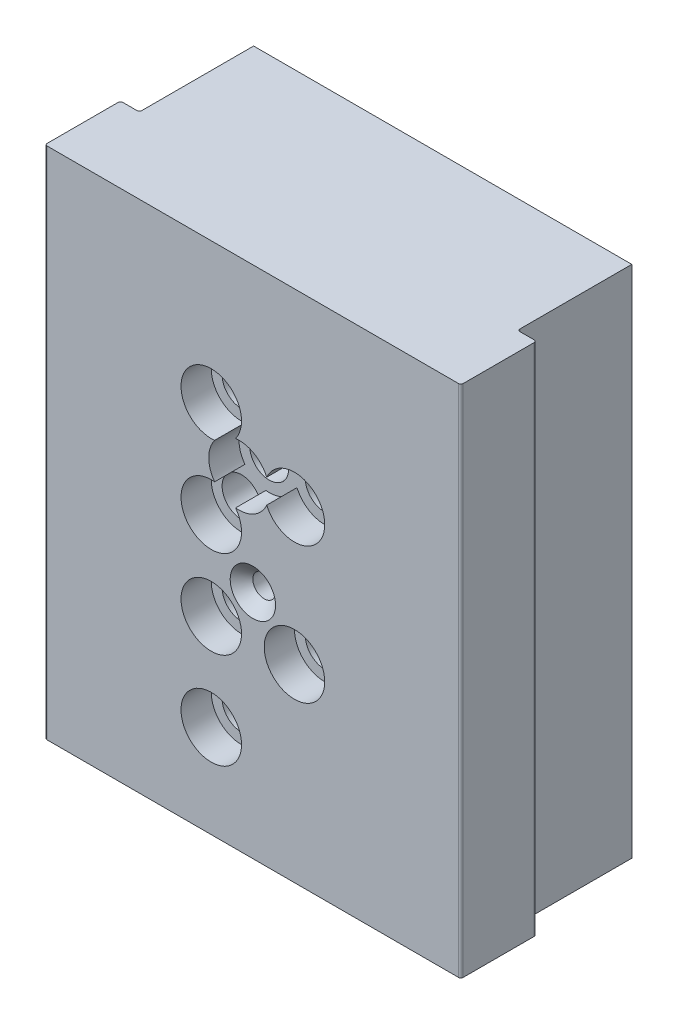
from build123d import *
from OCP.BRepFilletAPI import BRepFilletAPI_MakeChamfer

# Parameters (mm, degrees)
SECTION_PROFIL_DEPTH             = 68
CONG_2_R                         = 0.3
ESQUISSE2_R                      = 1.5
CAROTTE_CENTRALE_DEPTH           = 78.053293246
CAROTTE_CENTRALE_DRAFT           = 2
ESQUISSE3_R                      = 1.5
C_NE_D_APPUI_BUSE_CENTRALE_DEPTH = 68
C_NE_D_APPUI_BUSE_CENTRALE_DRAFT = 45
ESQUISSE6_R                      = 2.569841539
ENL_V_MAT_EXTRU_1_DEPTH          = 50.2
ESQUISSE7_R                      = 2.57
ENL_V_MAT_EXTRU_2_DEPTH          = 78.525866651
ENL_V_MAT_EXTRU_3_DEPTH          = 4
ESQUISSE9_R                      = 2.569841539
ENL_V_MAT_EXTRU_4_DEPTH          = 78.525866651
ESQUISSE10_R                     = 4
ENL_V_MAT_EXTRU_5_DEPTH          = 4
ESQUISSE11_R                     = 4
BOSS_EXTRU_1_DEPTH               = 4
BOSS_EXTRU_1_DRAFT               = 5
BOSS_EXTRU_1_PROFILE_2_DEPTH     = 4
BOSS_EXTRU_1_PROFILE_2_DRAFT     = 5
CHANFREIN1_SIZE                  = 0.5
CHANFREIN1_SIZE2                 = 0.550031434


with BuildPart() as part:
    # Esquisse1 → section profil (new body)
    with BuildSketch(Plane(origin=(0, 0, 0), x_dir=(1, 0, 0), z_dir=(0, 1, 0))):
        Polygon((-25, 25.1), (25, 25.1), (25, 10), (27.5, 10), (27.5, 0), (-27.5, 0), (-27.5, 10), (-25, 10), align=None)
    extrude(amount=SECTION_PROFIL_DEPTH)

    # Cong_2
    cong_2_edges = [part.edges().sort_by_distance(p)[0] for p in [
        (27.5, 34, 0),
        (-27.5, 34, 0),
        (-27.5, 34, -10),
        (-25, 34, -10),
        (25, 34, -10),
        (27.5, 34, -10),
    ]]
    fillet(cong_2_edges, radius=CONG_2_R)


with BuildPart() as carotte_centrale_tool:
    # Esquisse2 → carotte centrale (with draft: the straight prism first)
    with BuildSketch(Plane.XY.offset(-1.5)):
        with Locations((0, 30.5)):
            Circle(ESQUISSE2_R)
    extrude(amount=-CAROTTE_CENTRALE_DEPTH)
    # carotte centrale: the draft: its side faces are tilted about the plane it starts from
    carotte_centrale_sides = [carotte_centrale_tool.faces().sort_by_distance(p)[0] for p in [
        (-1.5, 30.5, -40.526646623),
    ]]
    draft(carotte_centrale_sides, Plane.XY.offset(-1.5), CAROTTE_CENTRALE_DRAFT)


with BuildPart() as part_1:
    add(part.part)

    # carotte centrale: cut by carotte_centrale_tool
    add(carotte_centrale_tool.part, mode=Mode.SUBTRACT)


with BuildPart() as c_ne_d_appui_buse_centrale_tool:
    # Esquisse3 → c_ne d_appui buse centrale (with draft: the straight prism first)
    with BuildSketch(Plane(origin=(0, 0, -1.5), x_dir=(-1, 0, 0), z_dir=(0, 0, -1))):
        with Locations((0, 30.5)):
            Circle(ESQUISSE3_R)
    extrude(amount=-C_NE_D_APPUI_BUSE_CENTRALE_DEPTH)
    # c_ne d_appui buse centrale: the draft: its side faces are tilted about the plane it starts from
    c_ne_d_appui_buse_centrale_sides = [c_ne_d_appui_buse_centrale_tool.faces().sort_by_distance(p)[0] for p in [
        (1.5, 30.5, 32.5),
    ]]
    draft(c_ne_d_appui_buse_centrale_sides, Plane(origin=(0, 0, -1.5), x_dir=(-1, 0, 0), z_dir=(0, 0, -1)), C_NE_D_APPUI_BUSE_CENTRALE_DRAFT)


with BuildPart() as part_2:
    add(part_1.part)

    # c_ne d_appui buse centrale: cut by c_ne_d_appui_buse_centrale_tool
    add(c_ne_d_appui_buse_centrale_tool.part, mode=Mode.SUBTRACT)

    # Esquisse6 → Enl_v. mat.-Extru.1 (cut)
    with BuildSketch(Plane.XY):
        with Locations((-5.5, 49.350852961)):
            Circle(ESQUISSE6_R)
        with Locations((-1.833333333, 43)):
            Circle(ESQUISSE6_R)
        with Locations((5.5, 43)):
            Circle(ESQUISSE6_R)
        with Locations((-5.5, 36.649147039)):
            Circle(ESQUISSE6_R)
    extrude(amount=-ENL_V_MAT_EXTRU_1_DEPTH, mode=Mode.SUBTRACT)

    # Esquisse7 → Enl_v. mat.-Extru.2 (cut, through all)
    with BuildSketch(Plane.XY):
        with Locations((-5.5, 49.350852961)):
            Circle(ESQUISSE7_R)
        with Locations((-5.5, 36.649147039)):
            Circle(ESQUISSE7_R)
        with Locations((-1.833333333, 43)):
            Circle(ESQUISSE7_R)
        with Locations((5.5, 43)):
            Circle(ESQUISSE7_R)
    extrude(amount=-ENL_V_MAT_EXTRU_2_DEPTH, mode=Mode.SUBTRACT)

    # Esquisse8 → Enl_v. mat.-Extru.3 (cut)
    with BuildSketch(Plane.XY):
        with BuildLine():
            ThreePointArc((-2.282229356, 46.974731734), (-7.5, 52.814954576), (-5.051103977, 45.376121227))
            ThreePointArc((-5.051103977, 45.376121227), (-5.833333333, 43), (-5.051103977, 40.623878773))
            ThreePointArc((-5.051103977, 40.623878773), (-7.5, 33.185045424), (-2.282229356, 39.025268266))
            ThreePointArc((-2.282229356, 39.025268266), (0.166666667, 39.535898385), (1.833333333, 41.401389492))
            ThreePointArc((1.833333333, 41.401389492), (9.5, 43), (1.833333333, 44.598610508))
            ThreePointArc((1.833333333, 44.598610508), (0.166666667, 46.464101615), (-2.282229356, 46.974731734))
        make_face()
    extrude(amount=-ENL_V_MAT_EXTRU_3_DEPTH, mode=Mode.SUBTRACT)

    # Esquisse9 → Enl_v. mat.-Extru.4 (cut, through all)
    with BuildSketch(Plane.XY):
        with Locations((-5.5, 25)):
            Circle(ESQUISSE9_R)
        with Locations((-5.5, 12.3)):
            Circle(ESQUISSE9_R)
        with Locations((5.5, 25)):
            Circle(ESQUISSE9_R)
    extrude(amount=-ENL_V_MAT_EXTRU_4_DEPTH, mode=Mode.SUBTRACT)

    # Esquisse10 → Enl_v. mat.-Extru.5 (cut)
    with BuildSketch(Plane.XY):
        with Locations((-5.5, 25)):
            Circle(ESQUISSE10_R)
        with Locations((-5.5, 12.3)):
            Circle(ESQUISSE10_R)
        with Locations((5.5, 25)):
            Circle(ESQUISSE10_R)
    extrude(amount=-ENL_V_MAT_EXTRU_5_DEPTH, mode=Mode.SUBTRACT)


with BuildPart() as boss_extru_1_tool:
    # Esquisse11 → Boss.-Extru.1 (with draft: the straight prism first)
    with BuildSketch(Plane(origin=(0, 0, -25.1), x_dir=(-1, 0, 0), z_dir=(0, 0, -1))):
        with Locations((17.3, 60)):
            Circle(ESQUISSE11_R)
    extrude(amount=BOSS_EXTRU_1_DEPTH)
    # Boss.-Extru.1: the draft: its side faces are tilted about the plane it starts from
    boss_extru_1_sides = [boss_extru_1_tool.faces().sort_by_distance(p)[0] for p in [
        (-13.3, 60, -27.1),
    ]]
    draft(boss_extru_1_sides, Plane(origin=(0, 0, -25.1), x_dir=(-1, 0, 0), z_dir=(0, 0, -1)), BOSS_EXTRU_1_DRAFT)


with BuildPart() as part_3:
    add(part_2.part)

    # Boss.-Extru.1: add boss_extru_1_tool
    add(boss_extru_1_tool.part)


with BuildPart() as boss_extru_1_profile_2_tool:
    # Esquisse11 → Boss.-Extru.1 profile 2 (with draft: the straight prism first)
    with BuildSketch(Plane(origin=(0, 0, -25.1), x_dir=(-1, 0, 0), z_dir=(0, 0, -1))):
        with Locations((-17.3, 8)):
            Circle(ESQUISSE11_R)
    extrude(amount=BOSS_EXTRU_1_PROFILE_2_DEPTH)
    # Boss.-Extru.1 profile 2: the draft: its side faces are tilted about the plane it starts from
    boss_extru_1_profile_2_sides = [boss_extru_1_profile_2_tool.faces().sort_by_distance(p)[0] for p in [
        (21.3, 8, -27.1),
    ]]
    draft(boss_extru_1_profile_2_sides, Plane(origin=(0, 0, -25.1), x_dir=(-1, 0, 0), z_dir=(0, 0, -1)), BOSS_EXTRU_1_PROFILE_2_DRAFT)


with BuildPart() as part_4:
    add(part_3.part)

    # Boss.-Extru.1 profile 2: add boss_extru_1_profile_2_tool
    add(boss_extru_1_profile_2_tool.part)

    # Chanfrein1: one chamfer whose edges measure the first distance from different faces: ONE call of the kernel's chamfer builder (chamfer() names one face for all edges)
    chanfrein1_edges_1 = [part_4.edges().sort_by_distance(p)[0] for p in [
        (-13.649954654, 60, -29.1),
    ]]
    chanfrein1_side_1 = [part_4.faces().sort_by_distance(p)[0] for p in [
        (-13.474977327, 60, -27.1),
    ]]
    chanfrein1_edges_2 = [part_4.edges().sort_by_distance(p)[0] for p in [
        (20.950045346, 8, -29.1),
    ]]
    chanfrein1_side_2 = [part_4.faces().sort_by_distance(p)[0] for p in [
        (21.125022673, 8, -27.1),
    ]]
    chanfrein1 = BRepFilletAPI_MakeChamfer(part_4.part.solid().wrapped)
    for e in chanfrein1_edges_1:
        chanfrein1.Add(CHANFREIN1_SIZE, CHANFREIN1_SIZE2, e.wrapped, chanfrein1_side_1[0].wrapped)  # the first distance lies on this face
    for e in chanfrein1_edges_2:
        chanfrein1.Add(CHANFREIN1_SIZE, CHANFREIN1_SIZE2, e.wrapped, chanfrein1_side_2[0].wrapped)  # the first distance lies on this face
    add(Compound.cast(chanfrein1.Shape()), mode=Mode.REPLACE)


solid = part_4.part
